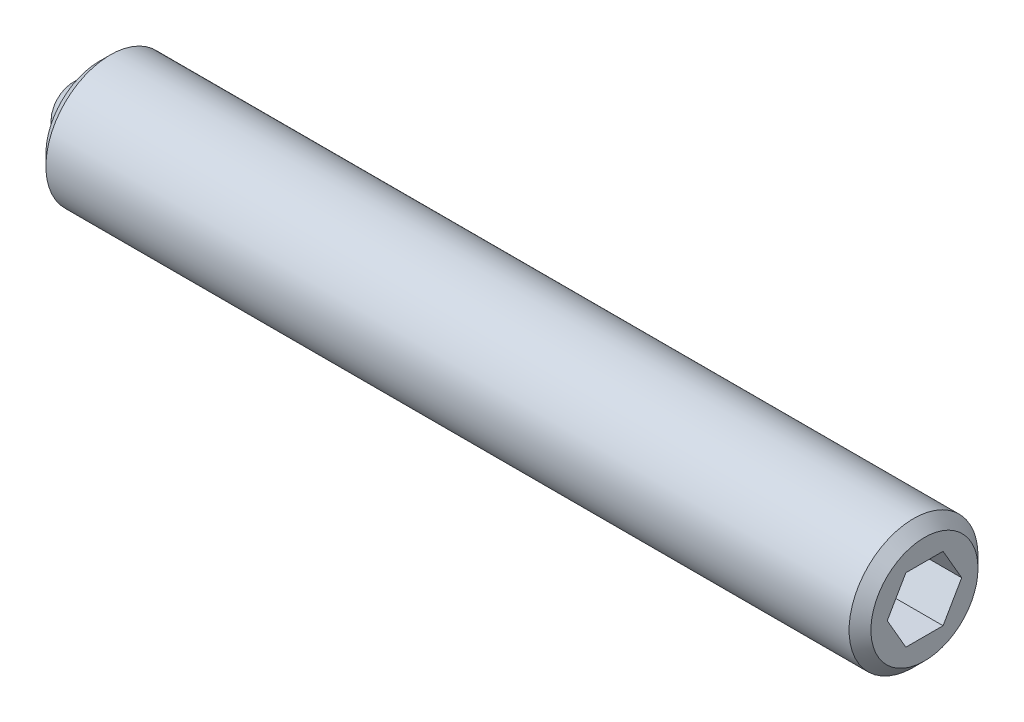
from build123d import *

# Parameters (mm, degrees)
SKETCH2_R           = 1.5
BOSS_EXTRUDE1_DEPTH = 19.2
CHAMFER1_SIZE       = 0.254
CHAMFER2_SIZE       = 0.254
CUT_EXTRUDE2_DEPTH  = 2
SKETCH3_R           = 0.8
CUT_EXTRUDE3_DEPTH  = 0.8
CUT_EXTRUDE4_DEPTH  = 0.8


with BuildPart() as part:
    # Sketch2 → Boss-Extrude1 (new body)
    with BuildSketch(Plane(origin=(0, 0, 0), x_dir=(0, 0, -1), z_dir=(1, 0, 0))):
        Circle(SKETCH2_R)
    extrude(amount=BOSS_EXTRUDE1_DEPTH)

    # Chamfer1
    chamfer1_edges = [part.edges().sort_by_distance(p)[0] for p in [
        (0, 0, 1.5),
    ]]
    chamfer(chamfer1_edges, length=CHAMFER1_SIZE)

    # Chamfer2
    chamfer2_edges = [part.edges().sort_by_distance(p)[0] for p in [
        (19.2, 0, 1.5),
    ]]
    chamfer(chamfer2_edges, length=CHAMFER2_SIZE)

    # Sketch4 → Cut-Extrude2 (cut)
    with BuildSketch(Plane(origin=(19.2, 0, 0), x_dir=(0, 0, -1), z_dir=(1, 0, 0))):
        Polygon((0.866025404, 0), (0.433012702, 0.75), (-0.433012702, 0.75), (-0.866025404, 0), (-0.433012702, -0.75), (0.433012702, -0.75), align=None)
    extrude(amount=-CUT_EXTRUDE2_DEPTH, mode=Mode.SUBTRACT)

    # Sketch3 → Cut-Extrude3 (cut)
    with BuildSketch(Plane.ZY):
        Circle(SKETCH3_R)
    extrude(amount=-CUT_EXTRUDE3_DEPTH, mode=Mode.SUBTRACT)

    # Sketch7 → Cut-Extrude4 (cut)
    with BuildSketch(Plane.ZY):
        with BuildLine():
            ThreePointArc((0.063449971, 0.797479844), (0, 0.8), (-0.063449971, 0.797479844))
            ThreePointArc((-0.063449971, 0.797479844), (0, 0.8635), (0.063449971, 0.797479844))
        make_face()
    extrude(amount=-CUT_EXTRUDE4_DEPTH, mode=Mode.SUBTRACT)


with BuildPart() as body_2:
    # Sketch5 → Revolve1 (revolve)
    with BuildSketch(Plane.ZY):
        with BuildLine():
            Line((0, 0), (0, -0.8))
            ThreePointArc((0, -0.8), (-0.8, 0), (0, 0.8))
            Line((0, 0.8), (0, 0))
        make_face()
    revolve(axis=Axis((0, 0, 0), (0, 1, 0)))


solid = Compound([part.part, body_2.part])
